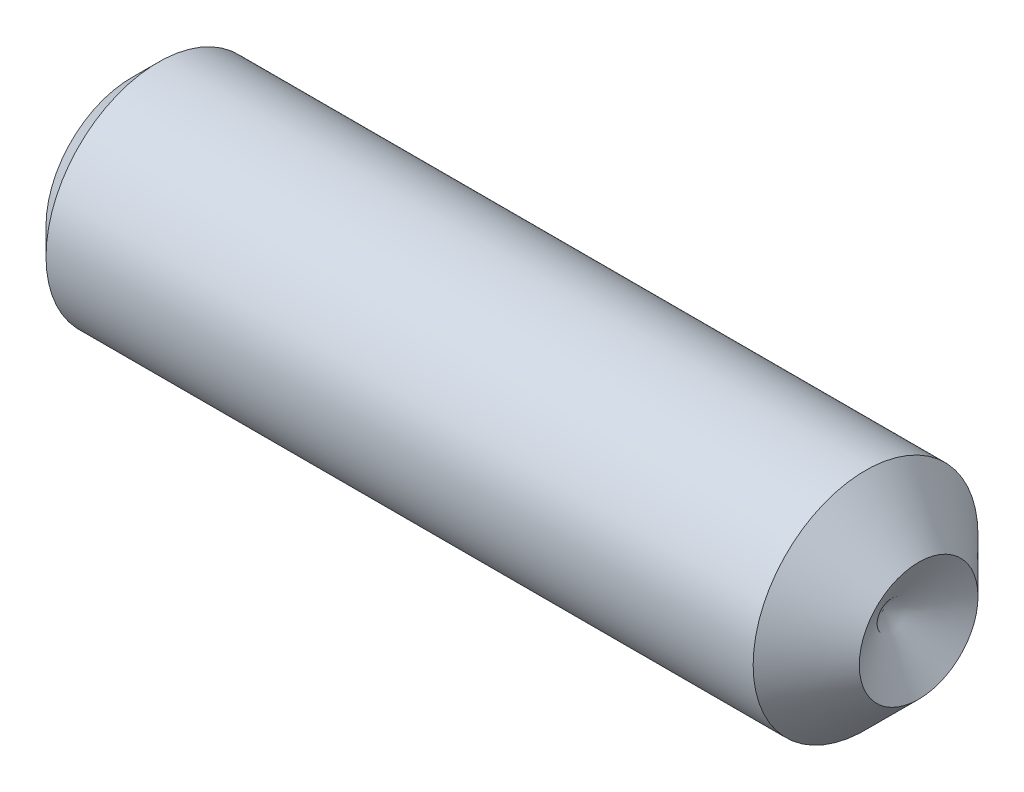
from build123d import *

# Parameters (mm, degrees)
HEX_2_DEPTH = 3.175


with BuildPart() as part:
    # BodySke → BaseBody (revolve)
    with BuildSketch(Plane.XY, mode=Mode.PRIVATE) as basebody_sk:
        Polygon((0, 0), (0, 2.41935), (0.75565, 3.175), (20.7264, 3.175), (22.225, 1.6764), (21.217717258, 0), align=None)
    revolve(basebody_sk.sketch.rotate(Axis((-12.7, 0, 0), (1, 0, 0)), 90), axis=Axis((-12.7, 0, 0), (1, 0, 0)))

    # Sketch2 → Hex 2 (cut)
    with BuildSketch(Plane.ZY):
        Polygon((0.916543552, 1.5875), (-0.916543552, 1.5875), (-1.833087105, 0), (-0.916543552, -1.5875), (0.916543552, -1.5875), (1.833087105, 0), align=None)
    extrude(amount=-HEX_2_DEPTH, mode=Mode.SUBTRACT)


solid = part.part
